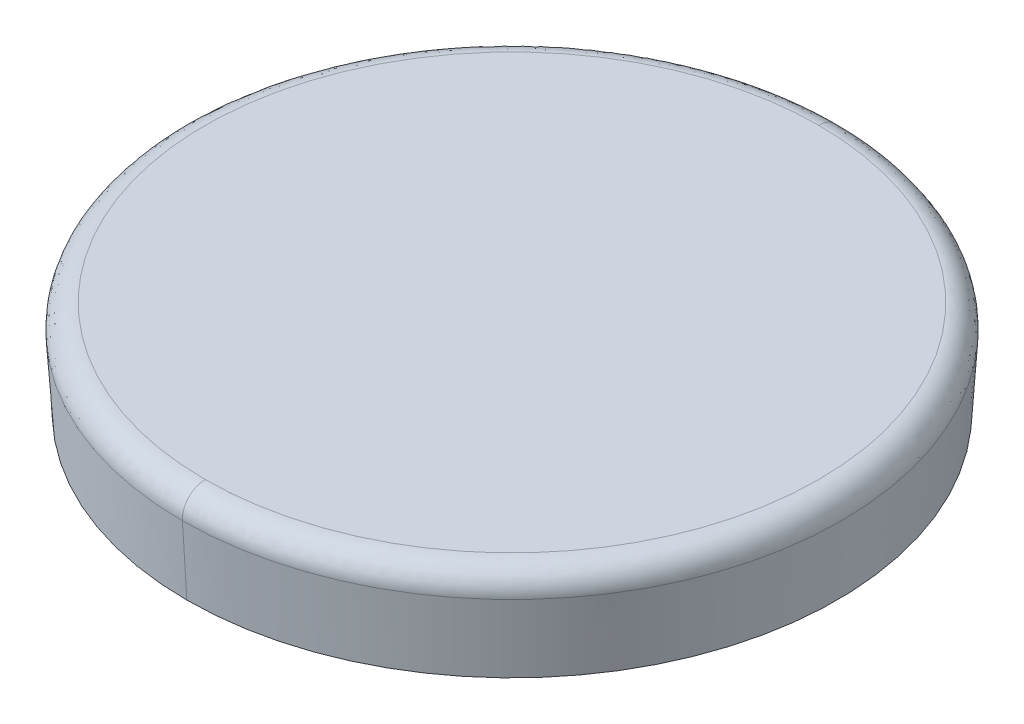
ISO-10303-21;
HEADER;
FILE_DESCRIPTION(('STEP AP214'),'2;1');
FILE_NAME('part.step','',(''),(''),'','','');
FILE_SCHEMA(('AUTOMOTIVE_DESIGN { 1 0 10303 214 1 1 1 1 }'));
ENDSEC;
DATA;
#1=APPLICATION_CONTEXT('core data for automotive mechanical design processes');
#2=APPLICATION_PROTOCOL_DEFINITION('international standard','automotive_design',2000,#1);
#3=PRODUCT_CONTEXT('',#1,'mechanical');
#4=PRODUCT('Part','Part','',(#3));
#5=PRODUCT_RELATED_PRODUCT_CATEGORY('part','',(#4));
#6=PRODUCT_DEFINITION_FORMATION('','',#4);
#7=PRODUCT_DEFINITION_CONTEXT('part definition',#1,'design');
#8=PRODUCT_DEFINITION('design','',#6,#7);
#9=PRODUCT_DEFINITION_SHAPE('','',#8);
#10=(LENGTH_UNIT() NAMED_UNIT(*) SI_UNIT(.MILLI.,.METRE.));
#11=(NAMED_UNIT(*) PLANE_ANGLE_UNIT() SI_UNIT($,.RADIAN.));
#12=(NAMED_UNIT(*) SI_UNIT($,.STERADIAN.) SOLID_ANGLE_UNIT());
#13=UNCERTAINTY_MEASURE_WITH_UNIT(LENGTH_MEASURE(1.E-05),#10,'distance_accuracy_value','');
#14=(GEOMETRIC_REPRESENTATION_CONTEXT(3) GLOBAL_UNCERTAINTY_ASSIGNED_CONTEXT((#13)) GLOBAL_UNIT_ASSIGNED_CONTEXT((#10,
#11,#12)) REPRESENTATION_CONTEXT('',''));
#15=CARTESIAN_POINT('',(0.,0.,0.));
#16=DIRECTION('',(0.,0.,1.));
#17=DIRECTION('',(1.,0.,0.));
#18=AXIS2_PLACEMENT_3D('',#15,#16,#17);
#19=CARTESIAN_POINT('',(40.5,13.2498606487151,16.8158571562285));
#20=CARTESIAN_POINT('',(48.5317143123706,13.2498606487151,16.8158571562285));
#21=CARTESIAN_POINT('',(48.5317143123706,13.2498606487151,8.78414284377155));
#22=CARTESIAN_POINT('',(40.5,13.2498606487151,8.78414284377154));
#23=CARTESIAN_POINT('',(40.5,13.255742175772,17.0087554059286));
#24=CARTESIAN_POINT('',(48.9175108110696,13.255742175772,17.0087554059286));
#25=CARTESIAN_POINT('',(48.9175108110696,13.255742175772,8.59124459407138));
#26=CARTESIAN_POINT('',(40.5,13.255742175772,8.59124459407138));
#27=CARTESIAN_POINT('',(40.5,13.1152805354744,17.1411771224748));
#28=CARTESIAN_POINT('',(49.182354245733,13.1152805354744,17.1411771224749));
#29=CARTESIAN_POINT('',(49.182354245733,13.1152805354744,8.45882287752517));
#30=CARTESIAN_POINT('',(40.5,13.1152805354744,8.45882287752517));
#31=CARTESIAN_POINT('',(40.5,12.9229709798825,17.1237799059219));
#32=CARTESIAN_POINT('',(49.1475598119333,12.9229709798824,17.1237799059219));
#33=CARTESIAN_POINT('',(49.1475598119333,12.9229709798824,8.47622009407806));
#34=CARTESIAN_POINT('',(40.5,12.9229709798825,8.47622009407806));
#35=(BOUNDED_SURFACE() B_SPLINE_SURFACE(3,3,((#19,#20,#21,#22),(#23,#24,#25,#26),(#27,#28,#29,
#30),(#31,#32,#33,#34)),.UNSPECIFIED.,.F.,.F.,.F.) B_SPLINE_SURFACE_WITH_KNOTS((4,4),(4,4),
(0.0430785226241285,0.95517601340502),(0.,1.),
.UNSPECIFIED.) GEOMETRIC_REPRESENTATION_ITEM() RATIONAL_B_SPLINE_SURFACE(((0.967717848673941,
0.322572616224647,0.322572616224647,0.967717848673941),(0.750138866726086,0.250046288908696,
0.250046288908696,0.750138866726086),(0.749723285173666,0.249907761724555,0.249907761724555,
0.749723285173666),(0.966471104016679,0.322157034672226,0.322157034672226,0.966471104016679))) REPRESENTATION_ITEM('') SURFACE());
#36=CARTESIAN_POINT('',(40.5,12.931231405,12.8));
#37=DIRECTION('',(0.,1.,0.));
#38=DIRECTION('',(0.,0.,1.));
#39=AXIS2_PLACEMENT_3D('',#36,#37,#38);
#40=CIRCLE('',#39,4.324412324);
#41=CARTESIAN_POINT('',(40.5,12.9312314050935,17.1244123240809));
#42=VERTEX_POINT('',#41);
#43=CARTESIAN_POINT('',(40.4999999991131,12.9312314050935,8.47558767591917));
#44=VERTEX_POINT('',#43);
#45=EDGE_CURVE('E82',#42,#44,#40,.T.);
#46=CARTESIAN_POINT('',(40.4999999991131,12.9312314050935,8.47558767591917));
#47=CARTESIAN_POINT('',(40.5,13.1154565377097,8.46403956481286));
#48=CARTESIAN_POINT('',(40.5,13.2500000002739,8.59041327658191));
#49=CARTESIAN_POINT('',(40.5,13.250000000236,8.77500000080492));
#50=(BOUNDED_CURVE() B_SPLINE_CURVE(3,(#46,#47,#48,#49),.UNSPECIFIED.,.F.,
.F.) B_SPLINE_CURVE_WITH_KNOTS((4,4),(0.0615373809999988,0.938462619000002),
.UNSPECIFIED.) CURVE() GEOMETRIC_REPRESENTATION_ITEM() RATIONAL_B_SPLINE_CURVE((0.954774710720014,
0.754036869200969,0.754036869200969,0.954774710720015)) REPRESENTATION_ITEM(''));
#51=CARTESIAN_POINT('',(40.5,13.250000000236,8.77500000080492));
#52=VERTEX_POINT('',#51);
#53=EDGE_CURVE('E103',#44,#52,#50,.T.);
#54=CARTESIAN_POINT('',(40.5,13.250000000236,16.8249999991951));
#55=CARTESIAN_POINT('',(40.6915795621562,13.25,16.8249999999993));
#56=CARTESIAN_POINT('',(40.9761392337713,13.25,16.8048749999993));
#57=CARTESIAN_POINT('',(41.3032085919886,13.25,16.7461770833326));
#58=CARTESIAN_POINT('',(41.4655140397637,13.25,16.7080234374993));
#59=CARTESIAN_POINT('',(41.5463594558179,13.25,16.6867454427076));
#60=CARTESIAN_POINT('',(41.5867053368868,13.25,16.675556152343));
#61=CARTESIAN_POINT('',(41.6039799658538,13.25,16.6706428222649));
#62=CARTESIAN_POINT('',(41.6154927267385,13.25,16.6673410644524));
#63=CARTESIAN_POINT('',(41.6201588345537,13.25,16.6659943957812));
#64=CARTESIAN_POINT('',(41.7364586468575,13.25,16.6320896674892));
#65=CARTESIAN_POINT('',(41.8981481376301,13.25,16.5774041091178));
#66=CARTESIAN_POINT('',(42.0824135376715,13.25,16.5016691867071));
#67=CARTESIAN_POINT('',(42.1734531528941,13.25,16.460817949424));
#68=CARTESIAN_POINT('',(42.2122358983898,13.25,16.4426708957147));
#69=CARTESIAN_POINT('',(42.2380390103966,13.25,16.4304307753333));
#70=CARTESIAN_POINT('',(42.2494252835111,13.25,16.424965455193));
#71=CARTESIAN_POINT('',(42.3784741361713,13.25,16.3620741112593));
#72=CARTESIAN_POINT('',(42.5459111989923,13.25,16.2703993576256));
#73=CARTESIAN_POINT('',(42.7331553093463,13.25,16.149761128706));
#74=CARTESIAN_POINT('',(42.8247525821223,13.25,16.0860209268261));
#75=CARTESIAN_POINT('',(42.8635746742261,13.25,16.0579706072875));
#76=CARTESIAN_POINT('',(42.8893596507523,13.25,16.039107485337));
#77=CARTESIAN_POINT('',(42.9008932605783,13.25,16.0305772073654));
#78=CARTESIAN_POINT('',(43.0278539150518,13.25,15.935382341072));
#79=CARTESIAN_POINT('',(43.1896861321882,13.25,15.8002410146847));
#80=CARTESIAN_POINT('',(43.365455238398,13.25,15.6282001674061));
#81=CARTESIAN_POINT('',(43.4500810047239,13.25,15.5385857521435));
#82=CARTESIAN_POINT('',(43.4856508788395,13.25,15.4994094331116));
#83=CARTESIAN_POINT('',(43.5092089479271,13.25,15.4731207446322));
#84=CARTESIAN_POINT('',(43.519943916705,13.25,15.4609979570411));
#85=CARTESIAN_POINT('',(43.6332568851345,13.25,15.3311944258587));
#86=CARTESIAN_POINT('',(43.7736659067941,13.25,15.1506015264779));
#87=CARTESIAN_POINT('',(43.9187952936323,13.25,14.9267471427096));
#88=CARTESIAN_POINT('',(43.9769905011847,13.25,14.8279889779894));
#89=CARTESIAN_POINT('',(44.0148977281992,13.25,14.7615234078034));
#90=CARTESIAN_POINT('',(44.032354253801,13.25,14.7299496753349));
#91=CARTESIAN_POINT('',(44.1279359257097,13.25,14.5507895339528));
#92=CARTESIAN_POINT('',(44.2289953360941,13.25,14.3303748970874));
#93=CARTESIAN_POINT('',(44.323030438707,13.25,14.0637351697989));
#94=CARTESIAN_POINT('',(44.3582167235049,13.25,13.9474275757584));
#95=CARTESIAN_POINT('',(44.3805376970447,13.25,13.8694373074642));
#96=CARTESIAN_POINT('',(44.3908390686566,13.25,13.8313607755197));
#97=CARTESIAN_POINT('',(44.4836720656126,13.25,13.466036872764));
#98=CARTESIAN_POINT('',(44.5249542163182,13.25,13.1350528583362));
#99=CARTESIAN_POINT('',(44.5250228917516,13.25,12.6324735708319));
#100=CARTESIAN_POINT('',(44.5095592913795,13.25,12.3829825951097));
#101=CARTESIAN_POINT('',(44.4643970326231,13.25,12.0950574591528));
#102=CARTESIAN_POINT('',(44.439230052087,13.25,11.9723354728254));
#103=CARTESIAN_POINT('',(44.4211605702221,13.25,11.8906707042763));
#104=CARTESIAN_POINT('',(44.4111454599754,13.25,11.8485949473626));
#105=CARTESIAN_POINT('',(44.3611873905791,13.25,11.6517740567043));
#106=CARTESIAN_POINT('',(44.287502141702,13.25,11.4207629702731));
#107=CARTESIAN_POINT('',(44.1774987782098,13.25,11.1603045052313));
#108=CARTESIAN_POINT('',(44.1164877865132,13.25,11.0323388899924));
#109=CARTESIAN_POINT('',(44.0890525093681,13.25,10.9779815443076));
#110=CARTESIAN_POINT('',(44.070476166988,13.25,10.9418511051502));
#111=CARTESIAN_POINT('',(44.0604777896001,13.25,10.9227760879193));
#112=CARTESIAN_POINT('',(43.9794129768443,13.25,10.7707324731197));
#113=CARTESIAN_POINT('',(43.8605027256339,13.25,10.5753128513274));
#114=CARTESIAN_POINT('',(43.7028323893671,13.25,10.3601073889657));
#115=CARTESIAN_POINT('',(43.61926179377,13.25,10.2557006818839));
#116=CARTESIAN_POINT('',(43.5824310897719,13.25,10.2116398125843));
#117=CARTESIAN_POINT('',(43.5576517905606,13.25,10.1824180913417));
#118=CARTESIAN_POINT('',(43.5441259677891,13.25,10.166710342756));
#119=CARTESIAN_POINT('',(43.4398004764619,13.25,10.0471391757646));
#120=CARTESIAN_POINT('',(43.2930583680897,13.25,9.89574698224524));
#121=CARTESIAN_POINT('',(43.1084866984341,13.25,9.73318580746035));
#122=CARTESIAN_POINT('',(43.012857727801,13.25,9.65542098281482));
#123=CARTESIAN_POINT('',(42.971157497,13.25,9.62284657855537));
#124=CARTESIAN_POINT('',(42.9431981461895,13.25,9.60129772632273));
#125=CARTESIAN_POINT('',(42.9277594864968,13.25,9.58957219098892));
#126=CARTESIAN_POINT('',(42.8129241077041,13.25,9.50342247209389));
#127=CARTESIAN_POINT('',(42.6549626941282,13.25,9.39624213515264));
#128=CARTESIAN_POINT('',(42.4621911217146,13.25,9.28464882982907));
#129=CARTESIAN_POINT('',(42.3636845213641,13.25,9.23221478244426));
#130=CARTESIAN_POINT('',(42.3210129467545,13.25,9.21046360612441));
#131=CARTESIAN_POINT('',(42.2924642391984,13.25,9.19612294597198));
#132=CARTESIAN_POINT('',(42.2765739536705,13.25,9.18826928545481));
#133=CARTESIAN_POINT('',(42.1612847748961,13.25,9.13204796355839));
#134=CARTESIAN_POINT('',(42.004829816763,13.25,9.06381427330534));
#135=CARTESIAN_POINT('',(41.8175109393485,13.25,8.99598242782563));
#136=CARTESIAN_POINT('',(41.7226544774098,13.25,8.96501003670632));
#137=CARTESIAN_POINT('',(41.6817452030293,13.25,8.95236691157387));
#138=CARTESIAN_POINT('',(41.654415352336,13.25,8.94407832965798));
#139=CARTESIAN_POINT('',(41.6391300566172,13.25,8.93953960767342));
#140=CARTESIAN_POINT('',(41.5299595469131,13.25,8.90768313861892));
#141=CARTESIAN_POINT('',(41.3830907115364,13.25,8.8707729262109));
#142=CARTESIAN_POINT('',(41.20945446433,13.25,8.83744990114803));
#143=CARTESIAN_POINT('',(41.1220640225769,13.25,8.82322311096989));
#144=CARTESIAN_POINT('',(41.0844883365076,13.25,8.81764764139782));
#145=CARTESIAN_POINT('',(41.0594106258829,13.25,8.81404660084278));
#146=CARTESIAN_POINT('',(41.0453629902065,13.25,8.81210361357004));
#147=CARTESIAN_POINT('',(40.8571567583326,13.25,8.78687315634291));
#148=CARTESIAN_POINT('',(40.6790594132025,13.25,8.77500000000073));
#149=CARTESIAN_POINT('',(40.5,13.250000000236,8.77500000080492));
#150=(BOUNDED_CURVE() B_SPLINE_CURVE(3,(#54,#55,#56,#57,#58,#59,#60,#61,#62,#63,#64,#65,#66,#67,
#68,#69,#70,#71,#72,#73,#74,#75,#76,#77,#78,#79,#80,#81,#82,#83,#84,#85,#86,#87,#88,#89,#90,#91,
#92,#93,#94,#95,#96,#97,#98,#99,#100,#101,#102,#103,#104,#105,#106,#107,#108,#109,#110,#111,
#112,#113,#114,#115,#116,#117,#118,#119,#120,#121,#122,#123,#124,#125,#126,#127,#128,#129,#130,
#131,#132,#133,#134,#135,#136,#137,#138,#139,#140,#141,#142,#143,#144,#145,#146,#147,#148,#149),
.UNSPECIFIED.,.F.,.F.) B_SPLINE_CURVE_WITH_KNOTS((4,1,1,1,1,1,2,2,1,1,1,2,2,1,1,1,2,2,1,1,1,2,2,
1,1,2,2,1,1,2,2,2,1,1,2,2,1,1,1,2,2,1,1,1,2,2,1,1,1,2,2,1,1,1,2,2,1,1,1,2,2,1,1,1,2,2,4),(0.,
0.062499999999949,0.0937499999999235,0.109374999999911,0.117187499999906,0.121093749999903,
0.123046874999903,0.124999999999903,0.156249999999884,0.171874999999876,0.179687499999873,
0.183593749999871,0.18749999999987,0.218749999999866,0.234374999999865,0.242187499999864,
0.246093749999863,0.249999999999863,0.281249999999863,0.296874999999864,0.304687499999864,
0.308593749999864,0.312499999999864,0.343749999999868,0.359374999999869,0.36718749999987,
0.374999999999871,0.406249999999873,0.421874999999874,0.429687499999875,0.437499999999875,0.5,
0.531249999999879,0.54687499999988,0.55468749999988,0.56249999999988,0.593749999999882,
0.609374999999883,0.617187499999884,0.621093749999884,0.624999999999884,0.656249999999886,
0.671874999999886,0.679687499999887,0.683593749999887,0.687499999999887,0.718749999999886,
0.734374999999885,0.742187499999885,0.746093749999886,0.749999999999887,0.781249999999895,
0.796874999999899,0.8046874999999,0.808593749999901,0.812499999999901,0.843749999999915,
0.859374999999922,0.867187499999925,0.871093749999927,0.874999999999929,0.906249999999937,
0.921874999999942,0.929687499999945,0.933593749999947,0.93749999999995,1.),
.UNSPECIFIED.) CURVE() GEOMETRIC_REPRESENTATION_ITEM() RATIONAL_B_SPLINE_CURVE((1.,1.,1.,1.,1.,
1.,1.,1.,1.,1.,1.,1.,1.,1.,1.,1.,1.,1.,1.,1.,1.,1.,1.,1.,1.,1.,1.,1.,1.,1.,1.,1.,1.,1.,1.,1.,1.,
1.,1.,1.,1.,1.,1.,1.,1.,1.,1.,1.,1.,1.,1.,1.,1.,1.,1.,1.,1.,1.,1.,1.,1.,1.,1.,1.,1.,1.,1.,1.,1.,
1.,1.,1.,1.,1.,1.,1.,1.,1.,1.,1.,1.,1.,1.,1.,1.,1.,1.,1.,1.,1.,1.,1.,1.,1.,1.,1.)) REPRESENTATION_ITEM(''));
#151=CARTESIAN_POINT('',(40.5,13.250000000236,16.8249999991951));
#152=VERTEX_POINT('',#151);
#153=EDGE_CURVE('E11',#152,#52,#150,.T.);
#154=CARTESIAN_POINT('',(40.5,13.250000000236,16.8249999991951));
#155=CARTESIAN_POINT('',(40.5,13.2500000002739,17.0095867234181));
#156=CARTESIAN_POINT('',(40.5,13.1154565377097,17.1359604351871));
#157=CARTESIAN_POINT('',(40.5,12.9312314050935,17.1244123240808));
#158=(BOUNDED_CURVE() B_SPLINE_CURVE(3,(#154,#155,#156,#157),.UNSPECIFIED.,.F.,
.F.) B_SPLINE_CURVE_WITH_KNOTS((4,4),(0.0615373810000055,0.938462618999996),
.UNSPECIFIED.) CURVE() GEOMETRIC_REPRESENTATION_ITEM() RATIONAL_B_SPLINE_CURVE((0.95477471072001,
0.75403686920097,0.75403686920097,0.95477471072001)) REPRESENTATION_ITEM(''));
#159=EDGE_CURVE('E96',#152,#42,#158,.T.);
#160=ORIENTED_EDGE('',*,*,#45,.T.);
#161=ORIENTED_EDGE('',*,*,#53,.T.);
#162=ORIENTED_EDGE('',*,*,#153,.F.);
#163=ORIENTED_EDGE('',*,*,#159,.T.);
#164=EDGE_LOOP('',(#160,#161,#162,#163));
#165=FACE_BOUND('',#164,.T.);
#166=ADVANCED_FACE('F16',(#165),#35,.T.);
#167=CARTESIAN_POINT('',(36.4267,13.25,8.7267));
#168=DIRECTION('',(0.,1.,0.));
#169=DIRECTION('',(1.,0.,0.));
#170=AXIS2_PLACEMENT_3D('',#167,#168,#169);
#171=PLANE('',#170);
#172=ORIENTED_EDGE('',*,*,#153,.T.);
#173=CARTESIAN_POINT('',(40.5,13.250000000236,16.8249999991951));
#174=CARTESIAN_POINT('',(32.450000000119,13.2500000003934,16.8249999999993));
#175=CARTESIAN_POINT('',(32.450000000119,13.2500000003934,8.77500000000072));
#176=CARTESIAN_POINT('',(40.5,13.250000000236,8.77500000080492));
#177=(BOUNDED_CURVE() B_SPLINE_CURVE(3,(#173,#174,#175,#176),.UNSPECIFIED.,.F.,
.F.) B_SPLINE_CURVE_WITH_KNOTS((4,4),(0.,1.),
.UNSPECIFIED.) CURVE() GEOMETRIC_REPRESENTATION_ITEM() RATIONAL_B_SPLINE_CURVE((0.95477471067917,
0.318258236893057,0.318258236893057,0.95477471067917)) REPRESENTATION_ITEM(''));
#178=EDGE_CURVE('E28',#152,#52,#177,.T.);
#179=ORIENTED_EDGE('',*,*,#178,.F.);
#180=EDGE_LOOP('',(#172,#179));
#181=FACE_BOUND('',#180,.T.);
#182=ADVANCED_FACE('F120',(#181),#171,.T.);
#183=CARTESIAN_POINT('',(36.182769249,12.,17.117230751));
#184=DIRECTION('',(0.,-1.,0.));
#185=DIRECTION('',(0.,0.,-1.));
#186=AXIS2_PLACEMENT_3D('',#183,#184,#185);
#187=PLANE('',#186);
#188=CARTESIAN_POINT('',(40.5,12.,12.8));
#189=DIRECTION('',(0.,-1.,0.));
#190=DIRECTION('',(0.,0.,1.));
#191=AXIS2_PLACEMENT_3D('',#188,#189,#190);
#192=CIRCLE('',#191,4.26603829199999);
#193=CARTESIAN_POINT('',(40.5,12.,17.066038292));
#194=VERTEX_POINT('',#193);
#195=CARTESIAN_POINT('',(40.5,12.,8.53396170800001));
#196=VERTEX_POINT('',#195);
#197=EDGE_CURVE('E61',#194,#196,#192,.T.);
#198=ORIENTED_EDGE('',*,*,#197,.T.);
#199=CARTESIAN_POINT('',(40.5,12.,12.8));
#200=DIRECTION('',(0.,-1.,0.));
#201=DIRECTION('',(0.,0.,1.));
#202=AXIS2_PLACEMENT_3D('',#199,#200,#201);
#203=CIRCLE('',#202,4.26603829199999);
#204=EDGE_CURVE('E65',#196,#194,#203,.T.);
#205=ORIENTED_EDGE('',*,*,#204,.T.);
#206=EDGE_LOOP('',(#198,#205));
#207=FACE_BOUND('',#206,.T.);
#208=ADVANCED_FACE('F63',(#207),#187,.T.);
#209=CARTESIAN_POINT('',(40.5,13.2499988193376,8.77584180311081));
#210=CARTESIAN_POINT('',(32.4516836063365,13.2499988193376,8.77584180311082));
#211=CARTESIAN_POINT('',(32.4516836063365,13.2499988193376,16.8241581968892));
#212=CARTESIAN_POINT('',(40.5,13.2499988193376,16.8241581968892));
#213=CARTESIAN_POINT('',(40.5,13.2505303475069,8.58641762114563));
#214=CARTESIAN_POINT('',(32.0728352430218,13.2505303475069,8.58641762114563));
#215=CARTESIAN_POINT('',(32.0728352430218,13.2505303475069,17.0135823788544));
#216=CARTESIAN_POINT('',(40.5,13.2505303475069,17.0135823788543));
#217=CARTESIAN_POINT('',(40.5,13.1107466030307,8.45923303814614));
#218=CARTESIAN_POINT('',(31.8184660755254,13.1107466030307,8.45923303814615));
#219=CARTESIAN_POINT('',(31.8184660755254,13.1107466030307,17.1407669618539));
#220=CARTESIAN_POINT('',(40.5,13.1107466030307,17.1407669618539));
#221=CARTESIAN_POINT('',(40.5,12.9229709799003,8.47622009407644));
#222=CARTESIAN_POINT('',(31.8524401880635,12.9229709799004,8.47622009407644));
#223=CARTESIAN_POINT('',(31.8524401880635,12.9229709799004,17.1237799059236));
#224=CARTESIAN_POINT('',(40.5,12.9229709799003,17.1237799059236));
#225=(BOUNDED_SURFACE() B_SPLINE_SURFACE(3,3,((#209,#210,#211,#212),(#213,#214,#215,#216),(#217,
#218,#219,#220),(#221,#222,#223,#224)),.UNSPECIFIED.,.F.,.F.,
.F.) B_SPLINE_SURFACE_WITH_KNOTS((4,4),(4,4),(0.0598484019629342,0.955176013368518),(0.,1.),
.UNSPECIFIED.) GEOMETRIC_REPRESENTATION_ITEM() RATIONAL_B_SPLINE_SURFACE(((0.955936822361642,
0.31864560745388,0.31864560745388,0.955936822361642),(0.750196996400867,0.250065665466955,
0.250065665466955,0.750196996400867),(0.753708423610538,0.251236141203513,0.251236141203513,
0.753708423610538),(0.966471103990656,0.322157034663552,0.322157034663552,0.966471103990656))) REPRESENTATION_ITEM('') SURFACE());
#226=CARTESIAN_POINT('',(40.5,12.931231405,12.8));
#227=DIRECTION('',(0.,1.,0.));
#228=DIRECTION('',(0.,0.,1.));
#229=AXIS2_PLACEMENT_3D('',#226,#227,#228);
#230=CIRCLE('',#229,4.324412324);
#231=EDGE_CURVE('E70',#44,#42,#230,.T.);
#232=ORIENTED_EDGE('',*,*,#53,.F.);
#233=ORIENTED_EDGE('',*,*,#231,.T.);
#234=ORIENTED_EDGE('',*,*,#159,.F.);
#235=ORIENTED_EDGE('',*,*,#178,.T.);
#236=EDGE_LOOP('',(#232,#233,#234,#235));
#237=FACE_BOUND('',#236,.T.);
#238=ADVANCED_FACE('F119',(#237),#225,.T.);
#239=CARTESIAN_POINT('',(40.5,12.,12.8));
#240=DIRECTION('',(0.,1.,0.));
#241=DIRECTION('',(0.,0.,1.));
#242=AXIS2_PLACEMENT_3D('',#239,#240,#241);
#243=CONICAL_SURFACE('',#242,4.266038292,0.062602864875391);
#244=DIRECTION('',(0.,0.998041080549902,-0.0625619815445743));
#245=VECTOR('',#244,1.);
#246=CARTESIAN_POINT('',(40.5,12.,8.533961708));
#247=LINE('',#246,#245);
#248=EDGE_CURVE('E75',#196,#44,#247,.T.);
#249=ORIENTED_EDGE('',*,*,#248,.F.);
#250=ORIENTED_EDGE('',*,*,#197,.F.);
#251=DIRECTION('',(0.,0.998041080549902,0.0625619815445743));
#252=VECTOR('',#251,1.);
#253=CARTESIAN_POINT('',(40.5,12.,17.066038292));
#254=LINE('',#253,#252);
#255=EDGE_CURVE('E71',#194,#42,#254,.T.);
#256=ORIENTED_EDGE('',*,*,#255,.T.);
#257=ORIENTED_EDGE('',*,*,#231,.F.);
#258=EDGE_LOOP('',(#249,#250,#256,#257));
#259=FACE_BOUND('',#258,.T.);
#260=ADVANCED_FACE('F76',(#259),#243,.T.);
#261=CARTESIAN_POINT('',(40.5,12.,12.8));
#262=DIRECTION('',(0.,1.,0.));
#263=DIRECTION('',(0.,0.,1.));
#264=AXIS2_PLACEMENT_3D('',#261,#262,#263);
#265=CONICAL_SURFACE('',#264,4.266038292,0.062602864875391);
#266=ORIENTED_EDGE('',*,*,#204,.F.);
#267=ORIENTED_EDGE('',*,*,#248,.T.);
#268=ORIENTED_EDGE('',*,*,#45,.F.);
#269=ORIENTED_EDGE('',*,*,#255,.F.);
#270=EDGE_LOOP('',(#266,#267,#268,#269));
#271=FACE_BOUND('',#270,.T.);
#272=ADVANCED_FACE('F84',(#271),#265,.T.);
#273=CLOSED_SHELL('',(#166,#182,#208,#238,#260,#272));
#274=MANIFOLD_SOLID_BREP('B1',#273);
#275=ADVANCED_BREP_SHAPE_REPRESENTATION('',(#18,#274),#14);
#276=SHAPE_DEFINITION_REPRESENTATION(#9,#275);
ENDSEC;
END-ISO-10303-21;
